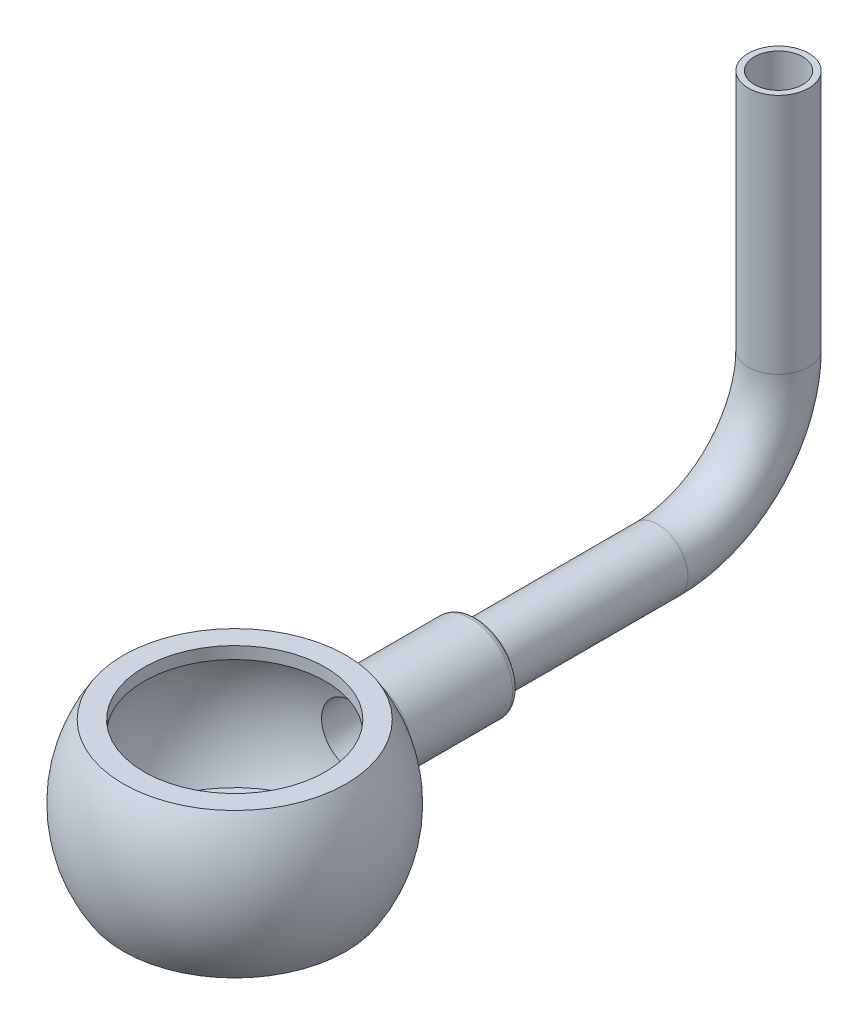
ISO-10303-21;
HEADER;
FILE_DESCRIPTION(('STEP AP214'),'2;1');
FILE_NAME('part.step','',(''),(''),'','','');
FILE_SCHEMA(('AUTOMOTIVE_DESIGN { 1 0 10303 214 1 1 1 1 }'));
ENDSEC;
DATA;
#1=APPLICATION_CONTEXT('core data for automotive mechanical design processes');
#2=APPLICATION_PROTOCOL_DEFINITION('international standard','automotive_design',2000,#1);
#3=PRODUCT_CONTEXT('',#1,'mechanical');
#4=PRODUCT('Part','Part','',(#3));
#5=PRODUCT_RELATED_PRODUCT_CATEGORY('part','',(#4));
#6=PRODUCT_DEFINITION_FORMATION('','',#4);
#7=PRODUCT_DEFINITION_CONTEXT('part definition',#1,'design');
#8=PRODUCT_DEFINITION('design','',#6,#7);
#9=PRODUCT_DEFINITION_SHAPE('','',#8);
#10=(LENGTH_UNIT() NAMED_UNIT(*) SI_UNIT(.MILLI.,.METRE.));
#11=(NAMED_UNIT(*) PLANE_ANGLE_UNIT() SI_UNIT($,.RADIAN.));
#12=(NAMED_UNIT(*) SI_UNIT($,.STERADIAN.) SOLID_ANGLE_UNIT());
#13=UNCERTAINTY_MEASURE_WITH_UNIT(LENGTH_MEASURE(1.E-05),#10,'distance_accuracy_value','');
#14=(GEOMETRIC_REPRESENTATION_CONTEXT(3) GLOBAL_UNCERTAINTY_ASSIGNED_CONTEXT((#13)) GLOBAL_UNIT_ASSIGNED_CONTEXT((#10,
#11,#12)) REPRESENTATION_CONTEXT('',''));
#15=CARTESIAN_POINT('',(0.,0.,0.));
#16=DIRECTION('',(0.,0.,1.));
#17=DIRECTION('',(1.,0.,0.));
#18=AXIS2_PLACEMENT_3D('',#15,#16,#17);
#19=CARTESIAN_POINT('',(0.,0.,0.));
#20=DIRECTION('',(0.,1.,0.));
#21=DIRECTION('',(0.,0.,-1.));
#22=AXIS2_PLACEMENT_3D('',#19,#20,#21);
#23=SPHERICAL_SURFACE('',#22,11.);
#24=CARTESIAN_POINT('',(0.,0.,-10.1972729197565));
#25=DIRECTION('',(0.,0.,1.));
#26=DIRECTION('',(1.,0.,0.));
#27=AXIS2_PLACEMENT_3D('',#24,#25,#26);
#28=CIRCLE('',#27,4.125);
#29=CARTESIAN_POINT('',(4.125,0.,-10.1972729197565));
#30=VERTEX_POINT('',#29);
#31=EDGE_CURVE('E50',#30,#30,#28,.T.);
#32=ORIENTED_EDGE('',*,*,#31,.T.);
#33=EDGE_LOOP('',(#32));
#34=FACE_BOUND('',#33,.T.);
#35=CARTESIAN_POINT('',(0.,-6.00000000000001,0.));
#36=DIRECTION('',(0.,1.,0.));
#37=DIRECTION('',(0.,0.,1.));
#38=AXIS2_PLACEMENT_3D('',#35,#36,#37);
#39=CIRCLE('',#38,9.21954445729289);
#40=CARTESIAN_POINT('',(0.,-6.00000000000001,9.21954445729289));
#41=VERTEX_POINT('',#40);
#42=EDGE_CURVE('E72',#41,#41,#39,.T.);
#43=ORIENTED_EDGE('',*,*,#42,.T.);
#44=EDGE_LOOP('',(#43));
#45=FACE_BOUND('',#44,.T.);
#46=CARTESIAN_POINT('',(0.,6.00000000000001,0.));
#47=DIRECTION('',(0.,1.,0.));
#48=DIRECTION('',(0.,0.,1.));
#49=AXIS2_PLACEMENT_3D('',#46,#47,#48);
#50=CIRCLE('',#49,9.21954445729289);
#51=CARTESIAN_POINT('',(0.,6.,9.21954445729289));
#52=VERTEX_POINT('',#51);
#53=EDGE_CURVE('E76',#52,#52,#50,.T.);
#54=ORIENTED_EDGE('',*,*,#53,.F.);
#55=EDGE_LOOP('',(#54));
#56=FACE_BOUND('',#55,.T.);
#57=ADVANCED_FACE('F38',(#34,#45,#56),#23,.T.);
#58=CARTESIAN_POINT('',(0.,5.,0.));
#59=DIRECTION('',(0.,1.,0.));
#60=DIRECTION('',(0.,0.,1.));
#61=AXIS2_PLACEMENT_3D('',#58,#59,#60);
#62=PLANE('',#61);
#63=CARTESIAN_POINT('',(0.,5.,0.));
#64=DIRECTION('',(0.,1.,0.));
#65=DIRECTION('',(0.,0.,1.));
#66=AXIS2_PLACEMENT_3D('',#63,#64,#65);
#67=CIRCLE('',#66,7.5);
#68=CARTESIAN_POINT('',(0.,5.,7.5));
#69=VERTEX_POINT('',#68);
#70=EDGE_CURVE('E63',#69,#69,#67,.T.);
#71=ORIENTED_EDGE('',*,*,#70,.T.);
#72=EDGE_LOOP('',(#71));
#73=FACE_BOUND('',#72,.T.);
#74=CARTESIAN_POINT('',(0.,5.,0.));
#75=DIRECTION('',(0.,1.,0.));
#76=DIRECTION('',(0.,0.,1.));
#77=AXIS2_PLACEMENT_3D('',#74,#75,#76);
#78=CIRCLE('',#77,8.66025403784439);
#79=CARTESIAN_POINT('',(0.,5.,8.66025403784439));
#80=VERTEX_POINT('',#79);
#81=EDGE_CURVE('E58',#80,#80,#78,.T.);
#82=ORIENTED_EDGE('',*,*,#81,.F.);
#83=EDGE_LOOP('',(#82));
#84=FACE_BOUND('',#83,.T.);
#85=ADVANCED_FACE('F135',(#73,#84),#62,.F.);
#86=CARTESIAN_POINT('',(0.,0.,0.));
#87=DIRECTION('',(0.,1.,0.));
#88=DIRECTION('',(0.,0.,-1.));
#89=AXIS2_PLACEMENT_3D('',#86,#87,#88);
#90=SPHERICAL_SURFACE('',#89,10.);
#91=CARTESIAN_POINT('',(0.,0.,-9.68245836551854));
#92=DIRECTION('',(0.,0.,1.));
#93=DIRECTION('',(1.,0.,0.));
#94=AXIS2_PLACEMENT_3D('',#91,#92,#93);
#95=CIRCLE('',#94,2.5);
#96=CARTESIAN_POINT('',(2.5,0.,-9.68245836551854));
#97=VERTEX_POINT('',#96);
#98=EDGE_CURVE('E90',#97,#97,#95,.T.);
#99=ORIENTED_EDGE('',*,*,#98,.F.);
#100=EDGE_LOOP('',(#99));
#101=FACE_BOUND('',#100,.T.);
#102=CARTESIAN_POINT('',(0.,-5.,0.));
#103=DIRECTION('',(0.,1.,0.));
#104=DIRECTION('',(0.,0.,1.));
#105=AXIS2_PLACEMENT_3D('',#102,#103,#104);
#106=CIRCLE('',#105,8.66025403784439);
#107=CARTESIAN_POINT('',(0.,-5.00000000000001,8.66025403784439));
#108=VERTEX_POINT('',#107);
#109=EDGE_CURVE('E68',#108,#108,#106,.T.);
#110=ORIENTED_EDGE('',*,*,#109,.F.);
#111=EDGE_LOOP('',(#110));
#112=FACE_BOUND('',#111,.T.);
#113=ORIENTED_EDGE('',*,*,#81,.T.);
#114=EDGE_LOOP('',(#113));
#115=FACE_BOUND('',#114,.T.);
#116=ADVANCED_FACE('F141',(#101,#112,#115),#90,.F.);
#117=CARTESIAN_POINT('',(0.,-5.,0.));
#118=DIRECTION('',(0.,-1.,0.));
#119=DIRECTION('',(0.,0.,-1.));
#120=AXIS2_PLACEMENT_3D('',#117,#118,#119);
#121=PLANE('',#120);
#122=CARTESIAN_POINT('',(0.,-5.,0.));
#123=DIRECTION('',(0.,-1.,0.));
#124=DIRECTION('',(0.,0.,-1.));
#125=AXIS2_PLACEMENT_3D('',#122,#123,#124);
#126=CIRCLE('',#125,7.5);
#127=CARTESIAN_POINT('',(0.,-5.,-7.5));
#128=VERTEX_POINT('',#127);
#129=EDGE_CURVE('E59',#128,#128,#126,.T.);
#130=ORIENTED_EDGE('',*,*,#129,.T.);
#131=EDGE_LOOP('',(#130));
#132=FACE_BOUND('',#131,.T.);
#133=ORIENTED_EDGE('',*,*,#109,.T.);
#134=EDGE_LOOP('',(#133));
#135=FACE_BOUND('',#134,.T.);
#136=ADVANCED_FACE('F154',(#132,#135),#121,.F.);
#137=CARTESIAN_POINT('',(0.,-6.00000000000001,0.));
#138=DIRECTION('',(0.,1.,0.));
#139=DIRECTION('',(0.,0.,1.));
#140=AXIS2_PLACEMENT_3D('',#137,#138,#139);
#141=CYLINDRICAL_SURFACE('',#140,7.5);
#142=CARTESIAN_POINT('',(0.,-6.00000000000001,0.));
#143=DIRECTION('',(0.,1.,0.));
#144=DIRECTION('',(0.,0.,1.));
#145=AXIS2_PLACEMENT_3D('',#142,#143,#144);
#146=CIRCLE('',#145,7.5);
#147=CARTESIAN_POINT('',(0.,-6.00000000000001,7.5));
#148=VERTEX_POINT('',#147);
#149=EDGE_CURVE('E64',#148,#148,#146,.T.);
#150=ORIENTED_EDGE('',*,*,#149,.F.);
#151=EDGE_LOOP('',(#150));
#152=FACE_BOUND('',#151,.T.);
#153=ORIENTED_EDGE('',*,*,#129,.F.);
#154=EDGE_LOOP('',(#153));
#155=FACE_BOUND('',#154,.T.);
#156=ADVANCED_FACE('F157',(#152,#155),#141,.F.);
#157=CARTESIAN_POINT('',(0.,6.00000000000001,0.));
#158=DIRECTION('',(0.,1.,0.));
#159=DIRECTION('',(0.,0.,1.));
#160=AXIS2_PLACEMENT_3D('',#157,#158,#159);
#161=CIRCLE('',#160,7.5);
#162=CARTESIAN_POINT('',(0.,6.00000000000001,7.5));
#163=VERTEX_POINT('',#162);
#164=EDGE_CURVE('E86',#163,#163,#161,.T.);
#165=ORIENTED_EDGE('',*,*,#164,.T.);
#166=EDGE_LOOP('',(#165));
#167=FACE_BOUND('',#166,.T.);
#168=ORIENTED_EDGE('',*,*,#70,.F.);
#169=EDGE_LOOP('',(#168));
#170=FACE_BOUND('',#169,.T.);
#171=ADVANCED_FACE('F152',(#167,#170),#141,.F.);
#172=CARTESIAN_POINT('',(0.,-6.00000000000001,0.));
#173=DIRECTION('',(0.,1.,0.));
#174=DIRECTION('',(0.,0.,1.));
#175=AXIS2_PLACEMENT_3D('',#172,#173,#174);
#176=PLANE('',#175);
#177=ORIENTED_EDGE('',*,*,#149,.T.);
#178=EDGE_LOOP('',(#177));
#179=FACE_BOUND('',#178,.T.);
#180=ORIENTED_EDGE('',*,*,#42,.F.);
#181=EDGE_LOOP('',(#180));
#182=FACE_BOUND('',#181,.T.);
#183=ADVANCED_FACE('F149',(#179,#182),#176,.F.);
#184=CARTESIAN_POINT('',(0.,6.00000000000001,0.));
#185=DIRECTION('',(0.,-1.,0.));
#186=DIRECTION('',(0.,0.,-1.));
#187=AXIS2_PLACEMENT_3D('',#184,#185,#186);
#188=PLANE('',#187);
#189=ORIENTED_EDGE('',*,*,#164,.F.);
#190=EDGE_LOOP('',(#189));
#191=FACE_BOUND('',#190,.T.);
#192=ORIENTED_EDGE('',*,*,#53,.T.);
#193=EDGE_LOOP('',(#192));
#194=FACE_BOUND('',#193,.T.);
#195=ADVANCED_FACE('F147',(#191,#194),#188,.F.);
#196=CARTESIAN_POINT('',(2.77555756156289E-11,0.,500000.));
#197=DIRECTION('',(0.,0.,-1.));
#198=DIRECTION('',(-1.,0.,0.));
#199=AXIS2_PLACEMENT_3D('',#196,#197,#198);
#200=CYLINDRICAL_SURFACE('',#199,3.5);
#201=CARTESIAN_POINT('',(0.,0.,-19.4999999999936));
#202=DIRECTION('',(0.,0.,1.));
#203=DIRECTION('',(1.,0.,0.));
#204=AXIS2_PLACEMENT_3D('',#201,#202,#203);
#205=CIRCLE('',#204,3.5);
#206=CARTESIAN_POINT('',(3.5,0.,-19.4999999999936));
#207=VERTEX_POINT('',#206);
#208=EDGE_CURVE('E46',#207,#207,#205,.T.);
#209=ORIENTED_EDGE('',*,*,#208,.T.);
#210=EDGE_LOOP('',(#209));
#211=FACE_BOUND('',#210,.T.);
#212=CARTESIAN_POINT('',(0.,0.,-11.124297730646));
#213=DIRECTION('',(0.,0.,1.));
#214=DIRECTION('',(1.,0.,0.));
#215=AXIS2_PLACEMENT_3D('',#212,#213,#214);
#216=CIRCLE('',#215,3.5);
#217=CARTESIAN_POINT('',(3.5,0.,-11.124297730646));
#218=VERTEX_POINT('',#217);
#219=EDGE_CURVE('E55',#218,#218,#216,.F.);
#220=ORIENTED_EDGE('',*,*,#219,.T.);
#221=EDGE_LOOP('',(#220));
#222=FACE_BOUND('',#221,.T.);
#223=ADVANCED_FACE('F174',(#211,#222),#200,.T.);
#224=CARTESIAN_POINT('',(0.,0.,11.001));
#225=DIRECTION('',(0.,0.,-1.));
#226=DIRECTION('',(-1.,0.,0.));
#227=AXIS2_PLACEMENT_3D('',#224,#225,#226);
#228=CYLINDRICAL_SURFACE('',#227,2.5);
#229=CARTESIAN_POINT('',(0.,0.,-15.));
#230=DIRECTION('',(0.,0.,1.));
#231=DIRECTION('',(1.,0.,0.));
#232=AXIS2_PLACEMENT_3D('',#229,#230,#231);
#233=CIRCLE('',#232,2.5);
#234=CARTESIAN_POINT('',(2.5,0.,-15.));
#235=VERTEX_POINT('',#234);
#236=EDGE_CURVE('E93',#235,#235,#233,.T.);
#237=ORIENTED_EDGE('',*,*,#236,.F.);
#238=EDGE_LOOP('',(#237));
#239=FACE_BOUND('',#238,.T.);
#240=ORIENTED_EDGE('',*,*,#98,.T.);
#241=EDGE_LOOP('',(#240));
#242=FACE_BOUND('',#241,.T.);
#243=ADVANCED_FACE('F165',(#239,#242),#228,.F.);
#244=CARTESIAN_POINT('',(0.,0.,-11.1242977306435));
#245=DIRECTION('',(0.,0.,1.));
#246=DIRECTION('',(1.,0.,0.));
#247=AXIS2_PLACEMENT_3D('',#244,#245,#246);
#248=TOROIDAL_SURFACE('',#247,4.5,1.);
#249=ORIENTED_EDGE('',*,*,#31,.F.);
#250=EDGE_LOOP('',(#249));
#251=FACE_BOUND('',#250,.T.);
#252=ORIENTED_EDGE('',*,*,#219,.F.);
#253=EDGE_LOOP('',(#252));
#254=FACE_BOUND('',#253,.T.);
#255=ADVANCED_FACE('F162',(#251,#254),#248,.F.);
#256=CARTESIAN_POINT('',(0.,0.,-15.));
#257=DIRECTION('',(0.,0.,1.));
#258=DIRECTION('',(1.,0.,0.));
#259=AXIS2_PLACEMENT_3D('',#256,#257,#258);
#260=PLANE('',#259);
#261=ORIENTED_EDGE('',*,*,#236,.T.);
#262=EDGE_LOOP('',(#261));
#263=FACE_BOUND('',#262,.T.);
#264=CARTESIAN_POINT('',(0.,0.,-15.));
#265=DIRECTION('',(0.,0.,1.));
#266=DIRECTION('',(1.,0.,0.));
#267=AXIS2_PLACEMENT_3D('',#264,#265,#266);
#268=CIRCLE('',#267,2.);
#269=CARTESIAN_POINT('',(2.,0.,-15.));
#270=VERTEX_POINT('',#269);
#271=EDGE_CURVE('E96',#270,#270,#268,.T.);
#272=ORIENTED_EDGE('',*,*,#271,.F.);
#273=EDGE_LOOP('',(#272));
#274=FACE_BOUND('',#273,.T.);
#275=ADVANCED_FACE('F164',(#263,#274),#260,.T.);
#276=CARTESIAN_POINT('',(0.,0.,-15.));
#277=DIRECTION('',(0.,0.,-1.));
#278=DIRECTION('',(-1.,0.,0.));
#279=AXIS2_PLACEMENT_3D('',#276,#277,#278);
#280=CYLINDRICAL_SURFACE('',#279,2.);
#281=ORIENTED_EDGE('',*,*,#271,.T.);
#282=EDGE_LOOP('',(#281));
#283=FACE_BOUND('',#282,.T.);
#284=CARTESIAN_POINT('',(0.,0.,-35.));
#285=DIRECTION('',(0.,0.,1.));
#286=DIRECTION('',(1.,0.,0.));
#287=AXIS2_PLACEMENT_3D('',#284,#285,#286);
#288=CIRCLE('',#287,2.);
#289=CARTESIAN_POINT('',(0.,-1.99999999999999,-35.));
#290=VERTEX_POINT('',#289);
#291=EDGE_CURVE('E114',#290,#290,#288,.T.);
#292=ORIENTED_EDGE('',*,*,#291,.F.);
#293=EDGE_LOOP('',(#292));
#294=FACE_BOUND('',#293,.T.);
#295=ADVANCED_FACE('F171',(#283,#294),#280,.F.);
#296=CARTESIAN_POINT('',(0.,10.,-45.));
#297=DIRECTION('',(0.,1.,0.));
#298=DIRECTION('',(0.,0.,1.));
#299=AXIS2_PLACEMENT_3D('',#296,#297,#298);
#300=CYLINDRICAL_SURFACE('',#299,2.5);
#301=CARTESIAN_POINT('',(0.,10.,-45.));
#302=DIRECTION('',(0.,-1.,0.));
#303=DIRECTION('',(1.,0.,0.));
#304=AXIS2_PLACEMENT_3D('',#301,#302,#303);
#305=CIRCLE('',#304,2.5);
#306=CARTESIAN_POINT('',(0.,10.,-47.5));
#307=VERTEX_POINT('',#306);
#308=EDGE_CURVE('E105',#307,#307,#305,.T.);
#309=ORIENTED_EDGE('',*,*,#308,.F.);
#310=EDGE_LOOP('',(#309));
#311=FACE_BOUND('',#310,.T.);
#312=CARTESIAN_POINT('',(0.,30.,-45.));
#313=DIRECTION('',(0.,-1.,0.));
#314=DIRECTION('',(1.,0.,0.));
#315=AXIS2_PLACEMENT_3D('',#312,#313,#314);
#316=CIRCLE('',#315,2.5);
#317=CARTESIAN_POINT('',(2.5,30.,-45.));
#318=VERTEX_POINT('',#317);
#319=EDGE_CURVE('E99',#318,#318,#316,.T.);
#320=ORIENTED_EDGE('',*,*,#319,.T.);
#321=EDGE_LOOP('',(#320));
#322=FACE_BOUND('',#321,.T.);
#323=ADVANCED_FACE('F264',(#311,#322),#300,.T.);
#324=CARTESIAN_POINT('',(0.,10.,-45.));
#325=DIRECTION('',(0.,1.,0.));
#326=DIRECTION('',(0.,0.,1.));
#327=AXIS2_PLACEMENT_3D('',#324,#325,#326);
#328=CYLINDRICAL_SURFACE('',#327,2.);
#329=CARTESIAN_POINT('',(0.,10.,-45.));
#330=DIRECTION('',(0.,-1.,0.));
#331=DIRECTION('',(1.,0.,0.));
#332=AXIS2_PLACEMENT_3D('',#329,#330,#331);
#333=CIRCLE('',#332,2.);
#334=CARTESIAN_POINT('',(0.,10.,-47.));
#335=VERTEX_POINT('',#334);
#336=EDGE_CURVE('E108',#335,#335,#333,.T.);
#337=ORIENTED_EDGE('',*,*,#336,.T.);
#338=EDGE_LOOP('',(#337));
#339=FACE_BOUND('',#338,.T.);
#340=CARTESIAN_POINT('',(0.,30.,-45.));
#341=DIRECTION('',(0.,-1.,0.));
#342=DIRECTION('',(1.,0.,0.));
#343=AXIS2_PLACEMENT_3D('',#340,#341,#342);
#344=CIRCLE('',#343,2.);
#345=CARTESIAN_POINT('',(2.,30.,-45.));
#346=VERTEX_POINT('',#345);
#347=EDGE_CURVE('E102',#346,#346,#344,.T.);
#348=ORIENTED_EDGE('',*,*,#347,.F.);
#349=EDGE_LOOP('',(#348));
#350=FACE_BOUND('',#349,.T.);
#351=ADVANCED_FACE('F270',(#339,#350),#328,.F.);
#352=CARTESIAN_POINT('',(0.,10.,-35.));
#353=DIRECTION('',(1.,0.,0.));
#354=DIRECTION('',(0.,0.,-1.));
#355=AXIS2_PLACEMENT_3D('',#352,#353,#354);
#356=TOROIDAL_SURFACE('',#355,10.,2.5);
#357=CARTESIAN_POINT('',(0.,0.,-35.));
#358=DIRECTION('',(0.,0.,1.));
#359=DIRECTION('',(1.,0.,0.));
#360=AXIS2_PLACEMENT_3D('',#357,#358,#359);
#361=CIRCLE('',#360,2.5);
#362=CARTESIAN_POINT('',(0.,-2.49999999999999,-35.));
#363=VERTEX_POINT('',#362);
#364=EDGE_CURVE('E111',#363,#363,#361,.T.);
#365=CARTESIAN_POINT('',(0.,10.,-35.));
#366=DIRECTION('',(1.,0.,0.));
#367=DIRECTION('',(0.,0.,-1.));
#368=AXIS2_PLACEMENT_3D('',#365,#366,#367);
#369=CIRCLE('',#368,12.5);
#370=EDGE_CURVE('',#363,#307,#369,.T.);
#371=ORIENTED_EDGE('',*,*,#364,.F.);
#372=ORIENTED_EDGE('',*,*,#308,.T.);
#373=ORIENTED_EDGE('',*,*,#370,.T.);
#374=ORIENTED_EDGE('',*,*,#370,.F.);
#375=EDGE_LOOP('',(#371,#373,#372,#374));
#376=FACE_BOUND('',#375,.T.);
#377=ADVANCED_FACE('F280',(#376),#356,.T.);
#378=CARTESIAN_POINT('',(0.,10.,-35.));
#379=DIRECTION('',(1.,0.,0.));
#380=DIRECTION('',(0.,0.,-1.));
#381=AXIS2_PLACEMENT_3D('',#378,#379,#380);
#382=TOROIDAL_SURFACE('',#381,10.,2.);
#383=CARTESIAN_POINT('',(0.,10.,-35.));
#384=DIRECTION('',(1.,0.,0.));
#385=DIRECTION('',(0.,0.,-1.));
#386=AXIS2_PLACEMENT_3D('',#383,#384,#385);
#387=CIRCLE('',#386,12.);
#388=EDGE_CURVE('',#290,#335,#387,.T.);
#389=ORIENTED_EDGE('',*,*,#291,.T.);
#390=ORIENTED_EDGE('',*,*,#336,.F.);
#391=ORIENTED_EDGE('',*,*,#388,.T.);
#392=ORIENTED_EDGE('',*,*,#388,.F.);
#393=EDGE_LOOP('',(#389,#391,#390,#392));
#394=FACE_BOUND('',#393,.T.);
#395=ADVANCED_FACE('F289',(#394),#382,.F.);
#396=CARTESIAN_POINT('',(0.,0.,-35.));
#397=DIRECTION('',(0.,0.,1.));
#398=DIRECTION('',(1.,0.,0.));
#399=AXIS2_PLACEMENT_3D('',#396,#397,#398);
#400=CYLINDRICAL_SURFACE('',#399,2.5);
#401=CARTESIAN_POINT('',(0.,0.,-20.5));
#402=DIRECTION('',(0.,0.,1.));
#403=DIRECTION('',(1.,0.,0.));
#404=AXIS2_PLACEMENT_3D('',#401,#402,#403);
#405=CIRCLE('',#404,2.5);
#406=CARTESIAN_POINT('',(2.5,0.,-20.5));
#407=VERTEX_POINT('',#406);
#408=EDGE_CURVE('E10',#407,#407,#405,.F.);
#409=ORIENTED_EDGE('',*,*,#408,.T.);
#410=EDGE_LOOP('',(#409));
#411=FACE_BOUND('',#410,.T.);
#412=ORIENTED_EDGE('',*,*,#364,.T.);
#413=EDGE_LOOP('',(#412));
#414=FACE_BOUND('',#413,.T.);
#415=ADVANCED_FACE('F131',(#411,#414),#400,.T.);
#416=CARTESIAN_POINT('',(0.,30.,-45.));
#417=DIRECTION('',(0.,-1.,0.));
#418=DIRECTION('',(1.,0.,0.));
#419=AXIS2_PLACEMENT_3D('',#416,#417,#418);
#420=PLANE('',#419);
#421=ORIENTED_EDGE('',*,*,#347,.T.);
#422=EDGE_LOOP('',(#421));
#423=FACE_BOUND('',#422,.T.);
#424=ORIENTED_EDGE('',*,*,#319,.F.);
#425=EDGE_LOOP('',(#424));
#426=FACE_BOUND('',#425,.T.);
#427=ADVANCED_FACE('F125',(#423,#426),#420,.F.);
#428=CARTESIAN_POINT('',(0.,0.,-20.5));
#429=DIRECTION('',(0.,0.,1.));
#430=DIRECTION('',(1.,0.,0.));
#431=AXIS2_PLACEMENT_3D('',#428,#429,#430);
#432=TOROIDAL_SURFACE('',#431,3.,0.5);
#433=ORIENTED_EDGE('',*,*,#408,.F.);
#434=EDGE_LOOP('',(#433));
#435=FACE_BOUND('',#434,.T.);
#436=CARTESIAN_POINT('',(0.,0.,-20.));
#437=DIRECTION('',(0.,0.,1.));
#438=DIRECTION('',(1.,0.,0.));
#439=AXIS2_PLACEMENT_3D('',#436,#437,#438);
#440=CIRCLE('',#439,3.);
#441=CARTESIAN_POINT('',(3.,0.,-20.));
#442=VERTEX_POINT('',#441);
#443=EDGE_CURVE('E42',#442,#442,#440,.T.);
#444=ORIENTED_EDGE('',*,*,#443,.F.);
#445=EDGE_LOOP('',(#444));
#446=FACE_BOUND('',#445,.T.);
#447=ADVANCED_FACE('F40',(#435,#446),#432,.F.);
#448=CARTESIAN_POINT('',(0.,0.,-19.4999999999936));
#449=DIRECTION('',(0.,0.,1.));
#450=DIRECTION('',(1.,0.,0.));
#451=AXIS2_PLACEMENT_3D('',#448,#449,#450);
#452=TOROIDAL_SURFACE('',#451,3.,0.5);
#453=ORIENTED_EDGE('',*,*,#443,.T.);
#454=EDGE_LOOP('',(#453));
#455=FACE_BOUND('',#454,.T.);
#456=ORIENTED_EDGE('',*,*,#208,.F.);
#457=EDGE_LOOP('',(#456));
#458=FACE_BOUND('',#457,.T.);
#459=ADVANCED_FACE('F121',(#455,#458),#452,.T.);
#460=CLOSED_SHELL('',(#57,#85,#116,#136,#156,#171,#183,#195,#223,#243,#255,#275,#295,#323,#351,
#377,#395,#415,#427,#447,#459));
#461=MANIFOLD_SOLID_BREP('B2',#460);
#462=ADVANCED_BREP_SHAPE_REPRESENTATION('',(#18,#461),#14);
#463=SHAPE_DEFINITION_REPRESENTATION(#9,#462);
ENDSEC;
END-ISO-10303-21;
